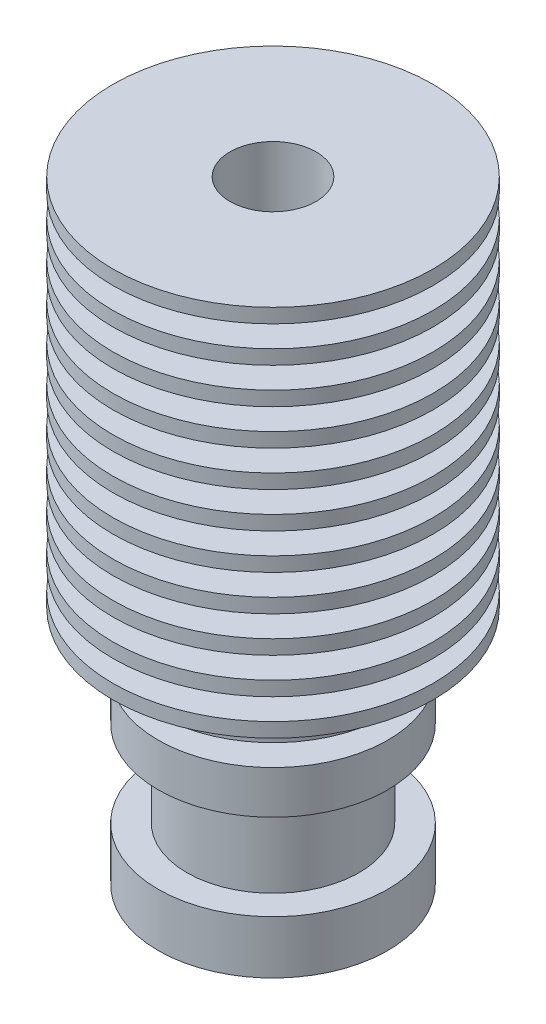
from build123d import *

# Parameters (mm, degrees)
ESQUISSE1_R                = 8
BOSS_EXTRU_1_DEPTH         = 3.7
ESQUISSE2_R                = 6
BOSS_EXTRU_2_DEPTH         = 6
ESQUISSE3_R                = 8
ESQUISSE3_R_2              = 2.1
BOSS_EXTRU_3_DEPTH         = 3
ESQUISSE4_R                = 4.5
BOSS_EXTRU_4_DEPTH         = 30
BOSS_EXTRU_4_DRAFT         = -3
ENL_V_MAT_EXTRU_1_REACH    = 46.173
ESQUISSE5_R                = 2.1
M7X1_01_D                  = 6
M7X1_01_DEPTH              = 14.8
M7X1_01_TIP                = 1.802581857
ESQUISSE9_R                = 8
ESQUISSE9_R_2              = 4.25
BOSS_EXTRU_5_DEPTH         = 1
ESQUISSE10_R               = 11.15
ESQUISSE10_R_2             = 4.25
BOSS_EXTRU_6_DEPTH         = 1
R_P_TITION_LIN_AIRE1_COUNT = 11
R_P_TITION_LIN_AIRE1_PITCH = 2.5
TROU_TARAUD_M51_D          = 4.2
TROU_TARAUD_M51_DEPTH      = 12.4
TROU_TARAUD_M51_TIP        = 1.2618073


with BuildPart() as part:
    # Esquisse1 → Boss.-Extru.1 (new body)
    with BuildSketch(Plane(origin=(0, 0, 0), x_dir=(1, 0, 0), z_dir=(0, 1, 0))):
        with Locations(Location((0, 0, 0), (0, 0, 270))):
            Circle(ESQUISSE1_R)
    extrude(amount=BOSS_EXTRU_1_DEPTH)

    # Esquisse2 → Boss.-Extru.2 (add)
    with BuildSketch(Plane(origin=(0, 3.7, 0), x_dir=(1, 0, 0), z_dir=(0, 1, 0))):
        with Locations(Location((0, 0, 0), (0, 0, 270))):
            Circle(ESQUISSE2_R)
    extrude(amount=BOSS_EXTRU_2_DEPTH)

    # Esquisse3 → Boss.-Extru.3 (add)
    with BuildSketch(Plane(origin=(0, 9.7, 0), x_dir=(1, 0, 0), z_dir=(0, 1, 0))):
        with Locations(Location((0, 0, 0), (0, 0, 270))):
            Circle(ESQUISSE3_R)
        with Locations(Location((0, 0, 0), (0, 0, 270))):
            Circle(ESQUISSE3_R_2, mode=Mode.SUBTRACT)
    extrude(amount=BOSS_EXTRU_3_DEPTH)


with BuildPart() as boss_extru_4_tool:
    # Esquisse4 → Boss.-Extru.4 (with draft: the straight prism first)
    with BuildSketch(Plane(origin=(0, 12.7, 0), x_dir=(1, 0, 0), z_dir=(0, 1, 0))):
        Circle(ESQUISSE4_R)
    extrude(amount=BOSS_EXTRU_4_DEPTH)
    # Boss.-Extru.4: the draft: its side faces are tilted about the plane it starts from
    boss_extru_4_sides = [boss_extru_4_tool.faces().sort_by_distance(p)[0] for p in [
        (-4.5, 27.7, 0),
    ]]
    draft(boss_extru_4_sides, Plane(origin=(0, 12.7, 0), x_dir=(1, 0, 0), z_dir=(0, 1, 0)), BOSS_EXTRU_4_DRAFT)


with BuildPart() as part_1:
    add(part.part)

    # Boss.-Extru.4: add boss_extru_4_tool
    add(boss_extru_4_tool.part)

    # Esquisse5 → Enl_v. mat.-Extru.1 (cut, up to next)
    with BuildSketch(Plane(origin=(0, 42.7, 0), x_dir=(1, 0, 0), z_dir=(0, 1, 0)), mode=Mode.PRIVATE) as enl_v_mat_extru_1_sk1:
        with Locations(Location((0, 0, 0), (0, 0, 270))):
            Circle(ESQUISSE5_R)
    enl_v_mat_extru_1_tool1 = extrude(enl_v_mat_extru_1_sk1.sketch, amount=-ENL_V_MAT_EXTRU_1_REACH, mode=Mode.PRIVATE) & part_1.part
    add(enl_v_mat_extru_1_tool1.solids().sort_by_distance((0, 42.7, 0))[0], mode=Mode.SUBTRACT)

    # M7x1.01
    with Locations(Plane(origin=(0, 42.7, 0), x_dir=(1, 0, 0), z_dir=(0, 1, 0))):
        with Locations((0, 0)):
            Hole(M7X1_01_D / 2, depth=M7X1_01_DEPTH)
            with Locations((0, 0, -(M7X1_01_DEPTH + M7X1_01_TIP / 2))):  # 118° drill point
                Cone(0, M7X1_01_D / 2, M7X1_01_TIP, mode=Mode.SUBTRACT)

    # Esquisse9 → Boss.-Extru.5 (add)
    with BuildSketch(Plane(origin=(0, 14.2, 0), x_dir=(1, 0, 0), z_dir=(0, 1, 0))):
        with Locations(Location((0, 0, 0), (0, 0, 270))):
            Circle(ESQUISSE9_R)
        Circle(ESQUISSE9_R_2, mode=Mode.SUBTRACT)
    extrude(amount=BOSS_EXTRU_5_DEPTH)

    # Esquisse10 → Boss.-Extru.6 (add)
    with BuildSketch(Plane(origin=(0, 16.7, 0), x_dir=(1, 0, 0), z_dir=(0, 1, 0))):
        with Locations(Location((0, 0, 0), (0, 0, 270))):
            Circle(ESQUISSE10_R)
        Circle(ESQUISSE10_R_2, mode=Mode.SUBTRACT)
    boss_extru_6 = extrude(amount=BOSS_EXTRU_6_DEPTH)

    # R_p_tition lin_aire1: Boss.-Extru.6 ×11
    with Locations(*[(0, i * R_P_TITION_LIN_AIRE1_PITCH, 0) for i in range(1, R_P_TITION_LIN_AIRE1_COUNT)]):
        add(boss_extru_6)

    # Trou taraud_ M51
    with Locations(Plane(origin=(0, 0, 0), x_dir=(-1, 0, 0), z_dir=(0, -1, 0))):
        with Locations((0, 0)):
            Hole(TROU_TARAUD_M51_D / 2, depth=TROU_TARAUD_M51_DEPTH)
            with Locations((0, 0, -(TROU_TARAUD_M51_DEPTH + TROU_TARAUD_M51_TIP / 2))):  # 118° drill point
                Cone(0, TROU_TARAUD_M51_D / 2, TROU_TARAUD_M51_TIP, mode=Mode.SUBTRACT)


solid = part_1.part
